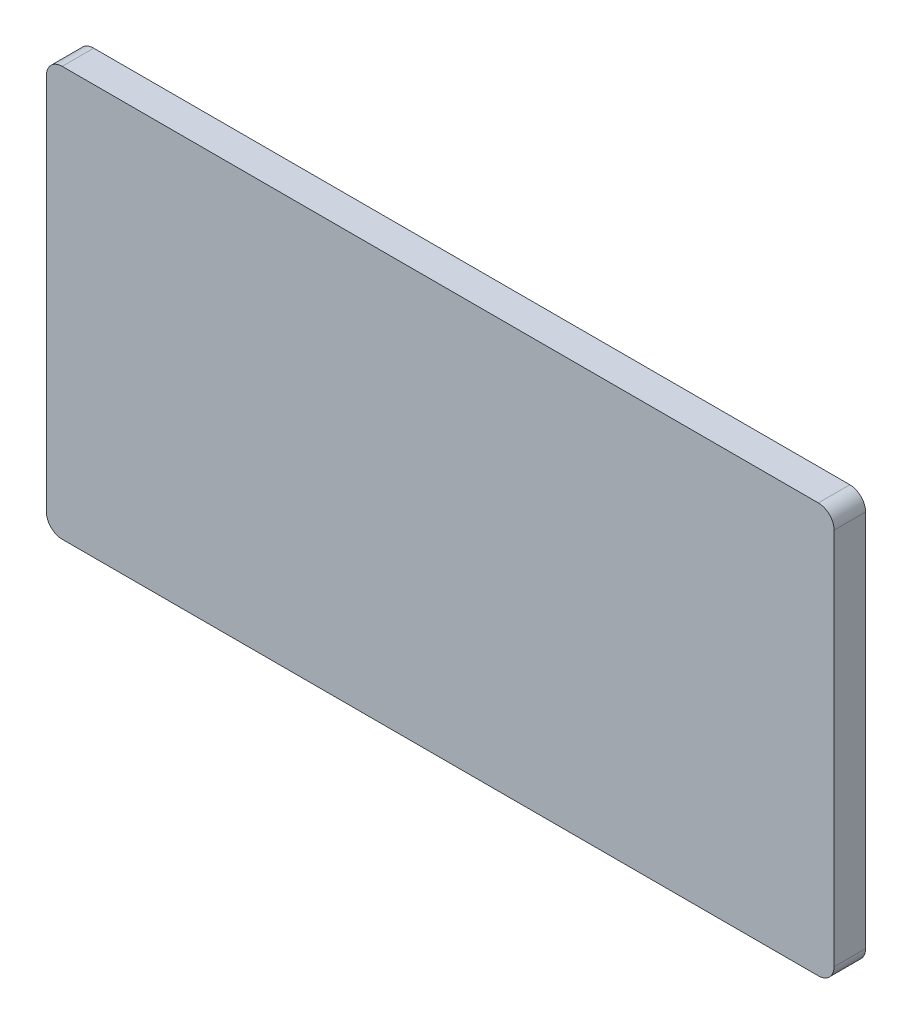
from build123d import *

# Parameters (mm, degrees)
ESQUISSE1_W      = 50
ESQUISSE1_H      = 26
EXTRUSION1_DEPTH = 2
CONG_1_R         = 1


with BuildPart() as part:
    # Esquisse1 → Extrusion1 (new body)
    with BuildSketch(Plane.XY):
        Rectangle(ESQUISSE1_W, ESQUISSE1_H)
    extrude(amount=EXTRUSION1_DEPTH)

    # Cong_1
    cong_1_edges = [part.edges().sort_by_distance(p)[0] for p in [
        (-25, 13, 1),
        (25, 13, 1),
        (25, -13, 1),
        (-25, -13, 1),
    ]]
    fillet(cong_1_edges, radius=CONG_1_R)


solid = part.part
